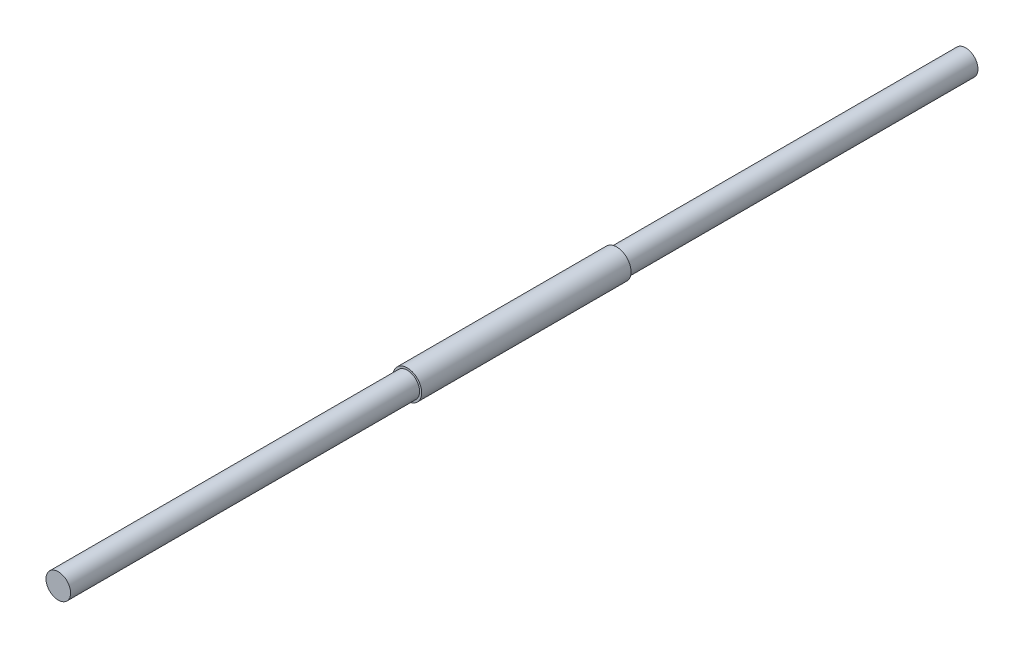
from build123d import *

# Parameters (mm, degrees)
SKETCH_1_R      = 3.5
EXTRUDE_1_DEPTH = 25.5
SKETCH_2_R      = 3
EXTRUDE_2_DEPTH = 85


with BuildPart() as part:
    # Sketch 1 → Extrude 1 (new, symmetric)
    with BuildSketch(Plane.XY):
        Circle(SKETCH_1_R)
    extrude(amount=EXTRUDE_1_DEPTH, both=True)

    # Sketch 2 → Extrude 2 (add)
    with BuildSketch(Plane.XY.offset(25.5)):
        Circle(SKETCH_2_R)
    extrude_2 = extrude(amount=EXTRUDE_2_DEPTH)

    # Mirror 1: Extrude 2 across plane
    add(extrude_2.mirror(Plane.XY))


solid = part.part
